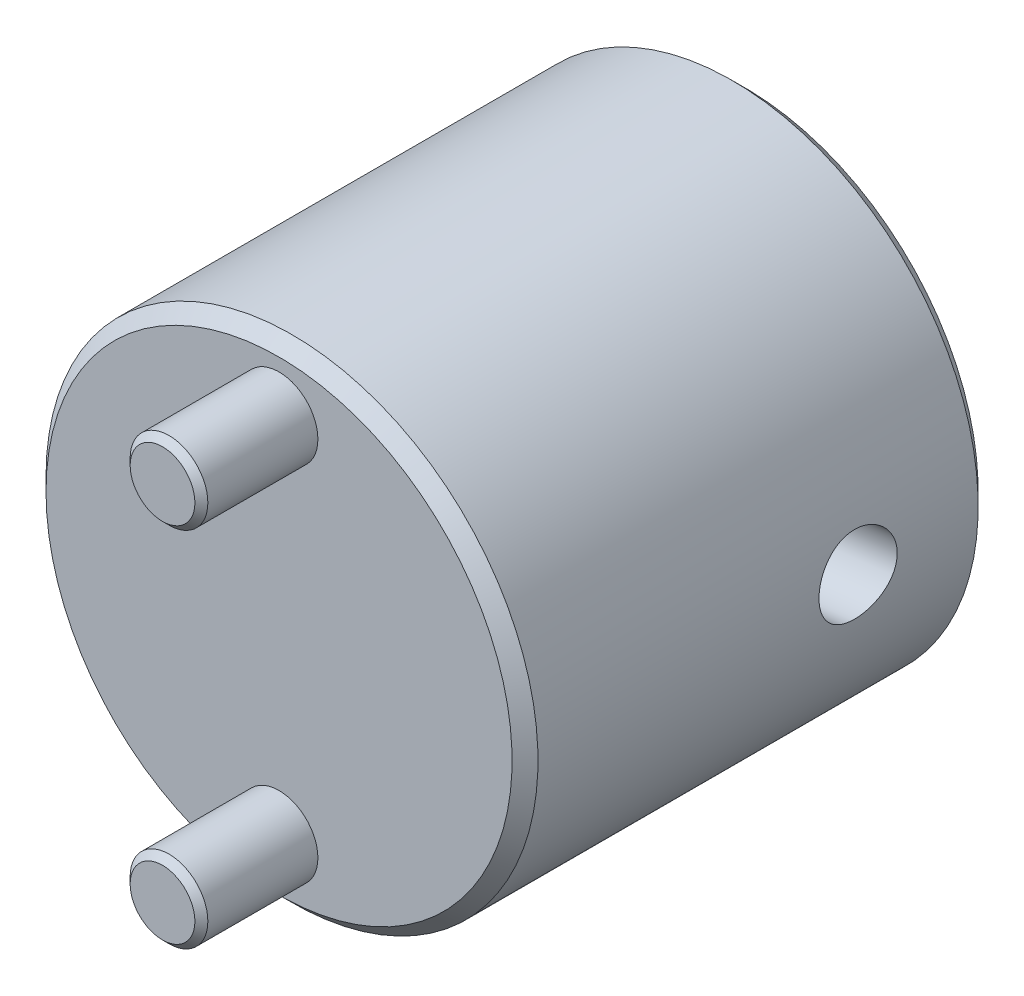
ISO-10303-21;
HEADER;
FILE_DESCRIPTION(('STEP AP214'),'2;1');
FILE_NAME('part.step','',(''),(''),'','','');
FILE_SCHEMA(('AUTOMOTIVE_DESIGN { 1 0 10303 214 1 1 1 1 }'));
ENDSEC;
DATA;
#1=APPLICATION_CONTEXT('core data for automotive mechanical design processes');
#2=APPLICATION_PROTOCOL_DEFINITION('international standard','automotive_design',2000,#1);
#3=PRODUCT_CONTEXT('',#1,'mechanical');
#4=PRODUCT('Part','Part','',(#3));
#5=PRODUCT_RELATED_PRODUCT_CATEGORY('part','',(#4));
#6=PRODUCT_DEFINITION_FORMATION('','',#4);
#7=PRODUCT_DEFINITION_CONTEXT('part definition',#1,'design');
#8=PRODUCT_DEFINITION('design','',#6,#7);
#9=PRODUCT_DEFINITION_SHAPE('','',#8);
#10=(LENGTH_UNIT() NAMED_UNIT(*) SI_UNIT(.MILLI.,.METRE.));
#11=(NAMED_UNIT(*) PLANE_ANGLE_UNIT() SI_UNIT($,.RADIAN.));
#12=(NAMED_UNIT(*) SI_UNIT($,.STERADIAN.) SOLID_ANGLE_UNIT());
#13=UNCERTAINTY_MEASURE_WITH_UNIT(LENGTH_MEASURE(1.E-05),#10,'distance_accuracy_value','');
#14=(GEOMETRIC_REPRESENTATION_CONTEXT(3) GLOBAL_UNCERTAINTY_ASSIGNED_CONTEXT((#13)) GLOBAL_UNIT_ASSIGNED_CONTEXT((#10,
#11,#12)) REPRESENTATION_CONTEXT('',''));
#15=CARTESIAN_POINT('',(0.,0.,0.));
#16=DIRECTION('',(0.,0.,1.));
#17=DIRECTION('',(1.,0.,0.));
#18=AXIS2_PLACEMENT_3D('',#15,#16,#17);
#19=CARTESIAN_POINT('',(0.,0.,9.));
#20=DIRECTION('',(0.,0.,1.));
#21=DIRECTION('',(1.,0.,0.));
#22=AXIS2_PLACEMENT_3D('',#19,#20,#21);
#23=PLANE('',#22);
#24=CARTESIAN_POINT('',(0.,14.,9.));
#25=DIRECTION('',(0.,0.,1.));
#26=DIRECTION('',(1.,0.,0.));
#27=AXIS2_PLACEMENT_3D('',#24,#25,#26);
#28=CIRCLE('',#27,2.49998893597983);
#29=CARTESIAN_POINT('',(2.49998893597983,14.,9.));
#30=VERTEX_POINT('',#29);
#31=EDGE_CURVE('E17',#30,#30,#28,.F.);
#32=ORIENTED_EDGE('',*,*,#31,.F.);
#33=EDGE_LOOP('',(#32));
#34=FACE_BOUND('',#33,.T.);
#35=ADVANCED_FACE('F14',(#34),#23,.T.);
#36=CARTESIAN_POINT('',(0.,0.,9.));
#37=DIRECTION('',(0.,0.,1.));
#38=DIRECTION('',(1.,0.,0.));
#39=AXIS2_PLACEMENT_3D('',#36,#37,#38);
#40=PLANE('',#39);
#41=CARTESIAN_POINT('',(0.,-14.,9.));
#42=DIRECTION('',(0.,0.,1.));
#43=DIRECTION('',(1.,0.,0.));
#44=AXIS2_PLACEMENT_3D('',#41,#42,#43);
#45=CIRCLE('',#44,2.49998893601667);
#46=CARTESIAN_POINT('',(2.49998893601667,-14.,9.));
#47=VERTEX_POINT('',#46);
#48=EDGE_CURVE('E114',#47,#47,#45,.F.);
#49=ORIENTED_EDGE('',*,*,#48,.F.);
#50=EDGE_LOOP('',(#49));
#51=FACE_BOUND('',#50,.T.);
#52=ADVANCED_FACE('F104',(#51),#40,.T.);
#53=CARTESIAN_POINT('',(-0.3439196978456,0.,-6.22361545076));
#54=DIRECTION('',(0.121869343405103,0.,0.992546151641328));
#55=DIRECTION('',(0.992546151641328,0.,-0.121869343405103));
#56=AXIS2_PLACEMENT_3D('',#53,#54,#55);
#57=PLANE('',#56);
#58=CARTESIAN_POINT('',(-0.34391969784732,0.,-6.22361545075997));
#59=DIRECTION('',(0.121869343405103,0.,0.992546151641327));
#60=DIRECTION('',(0.992546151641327,0.,-0.121869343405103));
#61=AXIS2_PLACEMENT_3D('',#58,#59,#60);
#62=CIRCLE('',#61,10.);
#63=CARTESIAN_POINT('',(9.58154181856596,0.,-7.44230888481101));
#64=VERTEX_POINT('',#63);
#65=EDGE_CURVE('E116',#64,#64,#62,.F.);
#66=ORIENTED_EDGE('',*,*,#65,.T.);
#67=EDGE_LOOP('',(#66));
#68=FACE_BOUND('',#67,.T.);
#69=ADVANCED_FACE('F101',(#68),#57,.F.);
#70=CARTESIAN_POINT('',(0.,14.,8.49999144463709));
#71=DIRECTION('',(0.,0.,-1.));
#72=DIRECTION('',(-1.,0.,0.));
#73=AXIS2_PLACEMENT_3D('',#70,#71,#72);
#74=CONICAL_SURFACE('',#73,2.99999527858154,0.785395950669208);
#75=CARTESIAN_POINT('',(0.,14.,8.49998672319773));
#76=DIRECTION('',(0.,0.,-1.));
#77=DIRECTION('',(-1.,0.,0.));
#78=AXIS2_PLACEMENT_3D('',#75,#76,#77);
#79=CIRCLE('',#78,3.);
#80=CARTESIAN_POINT('',(-3.,14.,8.49998672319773));
#81=VERTEX_POINT('',#80);
#82=EDGE_CURVE('E118',#81,#81,#79,.T.);
#83=ORIENTED_EDGE('',*,*,#82,.F.);
#84=EDGE_LOOP('',(#83));
#85=FACE_BOUND('',#84,.T.);
#86=ORIENTED_EDGE('',*,*,#31,.T.);
#87=EDGE_LOOP('',(#86));
#88=FACE_BOUND('',#87,.T.);
#89=ADVANCED_FACE('F97',(#85,#88),#74,.T.);
#90=CARTESIAN_POINT('',(0.,-14.,8.49999144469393));
#91=DIRECTION('',(0.,0.,-1.));
#92=DIRECTION('',(-1.,0.,0.));
#93=AXIS2_PLACEMENT_3D('',#90,#91,#92);
#94=CONICAL_SURFACE('',#93,2.99999527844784,0.785395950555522);
#95=CARTESIAN_POINT('',(0.,-14.,8.49998672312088));
#96=DIRECTION('',(0.,0.,-1.));
#97=DIRECTION('',(-1.,0.,0.));
#98=AXIS2_PLACEMENT_3D('',#95,#96,#97);
#99=CIRCLE('',#98,3.);
#100=CARTESIAN_POINT('',(-3.,-14.,8.49998672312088));
#101=VERTEX_POINT('',#100);
#102=EDGE_CURVE('E123',#101,#101,#99,.T.);
#103=ORIENTED_EDGE('',*,*,#102,.F.);
#104=EDGE_LOOP('',(#103));
#105=FACE_BOUND('',#104,.T.);
#106=ORIENTED_EDGE('',*,*,#48,.T.);
#107=EDGE_LOOP('',(#106));
#108=FACE_BOUND('',#107,.T.);
#109=ADVANCED_FACE('F92',(#105,#108),#94,.T.);
#110=CARTESIAN_POINT('',(-5.624587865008,0.,-49.23120637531));
#111=DIRECTION('',(0.121869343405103,0.,0.992546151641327));
#112=DIRECTION('',(0.992546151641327,0.,-0.121869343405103));
#113=AXIS2_PLACEMENT_3D('',#110,#111,#112);
#114=CYLINDRICAL_SURFACE('',#113,10.);
#115=CARTESIAN_POINT('',(-4.00000000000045,0.,-36.));
#116=DIRECTION('',(0.,0.,-1.));
#117=DIRECTION('',(1.,0.,0.));
#118=AXIS2_PLACEMENT_3D('',#115,#116,#117);
#119=ELLIPSE('',#118,10.0750982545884,10.);
#120=CARTESIAN_POINT('',(6.07509825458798,0.,-36.));
#121=VERTEX_POINT('',#120);
#122=EDGE_CURVE('E79',#121,#121,#119,.F.);
#123=ORIENTED_EDGE('',*,*,#122,.F.);
#124=EDGE_LOOP('',(#123));
#125=FACE_BOUND('',#124,.T.);
#126=ORIENTED_EDGE('',*,*,#65,.F.);
#127=EDGE_LOOP('',(#126));
#128=FACE_BOUND('',#127,.T.);
#129=CARTESIAN_POINT('',(7.14415495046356,0.,-27.2932319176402));
#130=CARTESIAN_POINT('',(7.14415015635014,0.164364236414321,-27.2932223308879));
#131=CARTESIAN_POINT('',(7.14174241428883,0.328908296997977,-27.2792642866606));
#132=CARTESIAN_POINT('',(7.13247673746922,0.653366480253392,-27.2239101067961));
#133=CARTESIAN_POINT('',(7.12561096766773,0.813271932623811,-27.1824656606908));
#134=CARTESIAN_POINT('',(7.10854535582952,1.12348315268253,-27.0737554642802));
#135=CARTESIAN_POINT('',(7.09835236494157,1.27380789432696,-27.0065427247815));
#136=CARTESIAN_POINT('',(7.07627779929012,1.56129290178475,-26.8485454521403));
#137=CARTESIAN_POINT('',(7.06439652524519,1.69845550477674,-26.7577651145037));
#138=CARTESIAN_POINT('',(7.04065275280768,1.95973946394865,-26.5526527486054));
#139=CARTESIAN_POINT('',(7.02879876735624,2.08342924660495,-26.4377699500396));
#140=CARTESIAN_POINT('',(7.00780745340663,2.31049290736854,-26.1891745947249));
#141=CARTESIAN_POINT('',(6.99867073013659,2.41386225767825,-26.0554578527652));
#142=CARTESIAN_POINT('',(6.98534004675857,2.59960101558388,-25.7695782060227));
#143=CARTESIAN_POINT('',(6.9812616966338,2.68144668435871,-25.6170684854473));
#144=CARTESIAN_POINT('',(6.98066469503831,2.81842825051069,-25.3004742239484));
#145=CARTESIAN_POINT('',(6.98414417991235,2.87357072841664,-25.1363925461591));
#146=CARTESIAN_POINT('',(6.99997315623,2.95403265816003,-24.8063432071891));
#147=CARTESIAN_POINT('',(7.01207156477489,2.98014390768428,-24.6405569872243));
#148=CARTESIAN_POINT('',(7.04529850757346,3.00427461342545,-24.3078656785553));
#149=CARTESIAN_POINT('',(7.06642485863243,3.00230085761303,-24.1409608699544));
#150=CARTESIAN_POINT('',(7.11607054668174,2.9709395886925,-23.8171315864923));
#151=CARTESIAN_POINT('',(7.1442954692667,2.94254427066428,-23.6600643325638));
#152=CARTESIAN_POINT('',(7.20687651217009,2.86074869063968,-23.3538736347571));
#153=CARTESIAN_POINT('',(7.24123327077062,2.80734582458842,-23.2047510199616));
#154=CARTESIAN_POINT('',(7.31431211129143,2.67631861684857,-22.9161375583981));
#155=CARTESIAN_POINT('',(7.35308764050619,2.59837186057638,-22.776807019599));
#156=CARTESIAN_POINT('',(7.43186085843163,2.42069837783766,-22.5131930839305));
#157=CARTESIAN_POINT('',(7.47185876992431,2.32096766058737,-22.3889124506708));
#158=CARTESIAN_POINT('',(7.55181517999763,2.09764727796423,-22.1532510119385));
#159=CARTESIAN_POINT('',(7.59170281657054,1.97323765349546,-22.0426219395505));
#160=CARTESIAN_POINT('',(7.66647751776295,1.70657662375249,-21.8431890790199));
#161=CARTESIAN_POINT('',(7.70136242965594,1.56431758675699,-21.7543946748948));
#162=CARTESIAN_POINT('',(7.76342571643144,1.26458300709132,-21.6004775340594));
#163=CARTESIAN_POINT('',(7.79054500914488,1.10700242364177,-21.5355352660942));
#164=CARTESIAN_POINT('',(7.83424939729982,0.782158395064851,-21.4323735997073));
#165=CARTESIAN_POINT('',(7.8508562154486,0.614915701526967,-21.3940990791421));
#166=CARTESIAN_POINT('',(7.86607548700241,0.371824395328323,-21.3591752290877));
#167=CARTESIAN_POINT('',(7.86955335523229,0.297737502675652,-21.3512260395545));
#168=CARTESIAN_POINT('',(7.87420270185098,0.149112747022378,-21.3406140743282));
#169=CARTESIAN_POINT('',(7.87537417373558,0.0745748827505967,-21.3379513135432));
#170=CARTESIAN_POINT('',(7.87536403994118,-0.164364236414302,-21.3379631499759));
#171=CARTESIAN_POINT('',(7.86965106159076,-0.328908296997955,-21.3509240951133));
#172=CARTESIAN_POINT('',(7.84726922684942,-0.653366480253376,-21.4023924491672));
#173=CARTESIAN_POINT('',(7.83058108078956,-0.813271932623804,-21.4409448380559));
#174=CARTESIAN_POINT('',(7.78772301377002,-1.12348315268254,-21.5422973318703));
#175=CARTESIAN_POINT('',(7.76157256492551,-1.27380789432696,-21.6050476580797));
#176=CARTESIAN_POINT('',(7.70193070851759,-1.56129290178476,-21.7530114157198));
#177=CARTESIAN_POINT('',(7.66844060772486,-1.69845550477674,-21.8382208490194));
#178=CARTESIAN_POINT('',(7.59578095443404,-1.95973946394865,-22.0314963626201));
#179=CARTESIAN_POINT('',(7.55648641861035,-2.08342924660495,-22.1400989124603));
#180=CARTESIAN_POINT('',(7.47597797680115,-2.31049290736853,-22.3762316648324));
#181=CARTESIAN_POINT('',(7.43476364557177,-2.41386225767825,-22.5037660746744));
#182=CARTESIAN_POINT('',(7.35266839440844,-2.59960101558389,-22.7779288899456));
#183=CARTESIAN_POINT('',(7.31181574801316,-2.68144668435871,-22.9249217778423));
#184=CARTESIAN_POINT('',(7.23464539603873,-2.81842825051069,-23.2319674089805));
#185=CARTESIAN_POINT('',(7.19832657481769,-2.87357072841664,-23.3920169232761));
#186=CARTESIAN_POINT('',(7.13383920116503,-2.95403265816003,-23.7160917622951));
#187=CARTESIAN_POINT('',(7.1054709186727,-2.98014390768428,-23.8798802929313));
#188=CARTESIAN_POINT('',(7.05722556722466,-3.00427461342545,-24.2107275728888));
#189=CARTESIAN_POINT('',(7.03734644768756,-3.00230085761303,-24.3777855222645));
#190=CARTESIAN_POINT('',(7.00717605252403,-2.9709395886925,-24.704006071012));
#191=CARTESIAN_POINT('',(6.9965645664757,-2.94254427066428,-24.8632359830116));
#192=CARTESIAN_POINT('',(6.98321245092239,-2.86074869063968,-25.1754712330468));
#193=CARTESIAN_POINT('',(6.98047264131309,-2.80734582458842,-25.3284759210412));
#194=CARTESIAN_POINT('',(6.98155881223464,-2.67631861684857,-25.626195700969));
#195=CARTESIAN_POINT('',(6.98547543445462,-2.59837186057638,-25.770768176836));
#196=CARTESIAN_POINT('',(6.99813476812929,-2.42069837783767,-26.045608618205));
#197=CARTESIAN_POINT('',(7.0068783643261,-2.32096766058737,-26.1758739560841));
#198=CARTESIAN_POINT('',(7.02744806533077,-2.09764727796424,-26.4238784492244));
#199=CARTESIAN_POINT('',(7.03938727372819,-1.97323765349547,-26.540871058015));
#200=CARTESIAN_POINT('',(7.06369367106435,-1.7065766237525,-26.7524695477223));
#201=CARTESIAN_POINT('',(7.07606104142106,-1.56431758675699,-26.847065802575));
#202=CARTESIAN_POINT('',(7.0990448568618,-1.26458300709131,-27.0114254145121));
#203=CARTESIAN_POINT('',(7.10964763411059,-1.10700242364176,-27.080999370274));
#204=CARTESIAN_POINT('',(7.12709674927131,-0.782158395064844,-27.1916697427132));
#205=CARTESIAN_POINT('',(7.13395082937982,-0.614915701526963,-27.2328248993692));
#206=CARTESIAN_POINT('',(7.14026917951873,-0.371824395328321,-27.2703932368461));
#207=CARTESIAN_POINT('',(7.14172065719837,-0.297737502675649,-27.2789476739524));
#208=CARTESIAN_POINT('',(7.14366463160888,-0.149112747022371,-27.2903691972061));
#209=CARTESIAN_POINT('',(7.14415712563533,-0.0745748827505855,-27.2932362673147));
#210=CARTESIAN_POINT('',(7.14415495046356,0.,-27.2932319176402));
#211=B_SPLINE_CURVE_WITH_KNOTS('',3,(#129,#130,#131,#132,#133,#134,#135,#136,#137,#138,#139,
#140,#141,#142,#143,#144,#145,#146,#147,#148,#149,#150,#151,#152,#153,#154,#155,#156,#157,#158,
#159,#160,#161,#162,#163,#164,#165,#166,#167,#168,#169,#170,#171,#172,#173,#174,#175,#176,#177,
#178,#179,#180,#181,#182,#183,#184,#185,#186,#187,#188,#189,#190,#191,#192,#193,#194,#195,#196,
#197,#198,#199,#200,#201,#202,#203,#204,#205,#206,#207,#208,#209,#210),.UNSPECIFIED.,.T.,.F.,(4,
2,2,2,2,2,2,2,2,2,2,2,2,2,2,2,2,2,2,2,2,2,2,2,2,2,2,2,2,2,2,2,2,2,2,2,2,2,2,2,4),(0.,
0.492805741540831,0.986479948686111,1.47914396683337,1.97172034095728,2.47709830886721,
2.98258875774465,3.49943124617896,4.01614630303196,4.51839363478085,5.02051957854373,
5.50451902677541,5.98856888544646,6.47926306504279,6.97004721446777,7.48124851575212,
7.99266913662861,8.507883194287,9.02202912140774,9.2456229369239,9.46921738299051,
9.96202312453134,10.4556973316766,10.9483613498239,11.4409377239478,11.9463156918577,
12.4518061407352,12.9686486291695,13.4853636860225,13.9876110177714,14.4897369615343,
14.9737364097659,15.457786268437,15.9484804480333,16.4392645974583,16.9504658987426,
17.4618865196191,17.9771005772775,18.4912465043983,18.7148403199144,18.938434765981),.UNSPECIFIED.);
#212=CARTESIAN_POINT('',(7.14415495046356,0.,-27.2932319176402));
#213=VERTEX_POINT('',#212);
#214=EDGE_CURVE('E76',#213,#213,#211,.T.);
#215=ORIENTED_EDGE('',*,*,#214,.T.);
#216=EDGE_LOOP('',(#215));
#217=FACE_BOUND('',#216,.T.);
#218=ADVANCED_FACE('F86',(#125,#128,#217),#114,.F.);
#219=CARTESIAN_POINT('',(0.,14.,0.));
#220=DIRECTION('',(0.,0.,1.));
#221=DIRECTION('',(1.,0.,0.));
#222=AXIS2_PLACEMENT_3D('',#219,#220,#221);
#223=CYLINDRICAL_SURFACE('',#222,3.);
#224=CARTESIAN_POINT('',(0.,14.,0.));
#225=DIRECTION('',(0.,0.,1.));
#226=DIRECTION('',(1.,0.,0.));
#227=AXIS2_PLACEMENT_3D('',#224,#225,#226);
#228=CIRCLE('',#227,3.);
#229=CARTESIAN_POINT('',(3.,14.,0.));
#230=VERTEX_POINT('',#229);
#231=EDGE_CURVE('E72',#230,#230,#228,.T.);
#232=ORIENTED_EDGE('',*,*,#231,.T.);
#233=EDGE_LOOP('',(#232));
#234=FACE_BOUND('',#233,.T.);
#235=ORIENTED_EDGE('',*,*,#82,.T.);
#236=EDGE_LOOP('',(#235));
#237=FACE_BOUND('',#236,.T.);
#238=ADVANCED_FACE('F91',(#234,#237),#223,.T.);
#239=CARTESIAN_POINT('',(0.,-14.,0.));
#240=DIRECTION('',(0.,0.,1.));
#241=DIRECTION('',(1.,0.,0.));
#242=AXIS2_PLACEMENT_3D('',#239,#240,#241);
#243=CYLINDRICAL_SURFACE('',#242,3.);
#244=CARTESIAN_POINT('',(0.,-14.,0.));
#245=DIRECTION('',(0.,0.,1.));
#246=DIRECTION('',(1.,0.,0.));
#247=AXIS2_PLACEMENT_3D('',#244,#245,#246);
#248=CIRCLE('',#247,3.);
#249=CARTESIAN_POINT('',(3.,-14.,0.));
#250=VERTEX_POINT('',#249);
#251=EDGE_CURVE('E68',#250,#250,#248,.T.);
#252=ORIENTED_EDGE('',*,*,#251,.T.);
#253=EDGE_LOOP('',(#252));
#254=FACE_BOUND('',#253,.T.);
#255=ORIENTED_EDGE('',*,*,#102,.T.);
#256=EDGE_LOOP('',(#255));
#257=FACE_BOUND('',#256,.T.);
#258=ADVANCED_FACE('F139',(#254,#257),#243,.T.);
#259=CARTESIAN_POINT('',(0.,0.,-36.));
#260=DIRECTION('',(0.,0.,-1.));
#261=DIRECTION('',(-1.,0.,0.));
#262=AXIS2_PLACEMENT_3D('',#259,#260,#261);
#263=PLANE('',#262);
#264=ORIENTED_EDGE('',*,*,#122,.T.);
#265=EDGE_LOOP('',(#264));
#266=FACE_BOUND('',#265,.T.);
#267=CARTESIAN_POINT('',(0.,0.,-36.));
#268=DIRECTION('',(0.,0.,-1.));
#269=DIRECTION('',(-1.,0.,0.));
#270=AXIS2_PLACEMENT_3D('',#267,#268,#269);
#271=CIRCLE('',#270,17.9999935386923);
#272=CARTESIAN_POINT('',(-17.9999935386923,0.,-36.));
#273=VERTEX_POINT('',#272);
#274=EDGE_CURVE('E38',#273,#273,#271,.F.);
#275=ORIENTED_EDGE('',*,*,#274,.F.);
#276=EDGE_LOOP('',(#275));
#277=FACE_BOUND('',#276,.T.);
#278=ADVANCED_FACE('F63',(#266,#277),#263,.T.);
#279=CARTESIAN_POINT('',(-6.088156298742,0.,-22.6459789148));
#280=DIRECTION('',(0.992546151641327,0.,-0.121869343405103));
#281=DIRECTION('',(-0.121869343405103,0.,-0.992546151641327));
#282=AXIS2_PLACEMENT_3D('',#279,#280,#281);
#283=CYLINDRICAL_SURFACE('',#282,3.);
#284=ORIENTED_EDGE('',*,*,#214,.F.);
#285=EDGE_LOOP('',(#284));
#286=FACE_BOUND('',#285,.T.);
#287=CARTESIAN_POINT('',(19.,0.,-22.7038876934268));
#288=CARTESIAN_POINT('',(18.999996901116,0.168375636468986,-22.7038949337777));
#289=CARTESIAN_POINT('',(18.9977368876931,0.336958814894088,-22.717947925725));
#290=CARTESIAN_POINT('',(18.9889306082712,0.669566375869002,-22.773855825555));
#291=CARTESIAN_POINT('',(18.9823758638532,0.833581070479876,-22.8157657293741));
#292=CARTESIAN_POINT('',(18.9657103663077,1.15205522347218,-22.9262623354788));
#293=CARTESIAN_POINT('',(18.9556024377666,1.30652215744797,-22.9948278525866));
#294=CARTESIAN_POINT('',(18.9329581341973,1.60156617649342,-23.1567661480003));
#295=CARTESIAN_POINT('',(18.9204227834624,1.74214908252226,-23.2501284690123));
#296=CARTESIAN_POINT('',(18.8943204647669,2.00554261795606,-23.4591755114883));
#297=CARTESIAN_POINT('',(18.8807533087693,2.12834999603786,-23.5748643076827));
#298=CARTESIAN_POINT('',(18.8541189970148,2.3526557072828,-23.825390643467));
#299=CARTESIAN_POINT('',(18.8410518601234,2.45415323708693,-23.9602289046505));
#300=CARTESIAN_POINT('',(18.8169550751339,2.63254643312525,-24.2446602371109));
#301=CARTESIAN_POINT('',(18.8059169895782,2.70954499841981,-24.394188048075));
#302=CARTESIAN_POINT('',(18.7870561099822,2.83737969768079,-24.7042177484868));
#303=CARTESIAN_POINT('',(18.7792331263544,2.88821737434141,-24.8647189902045));
#304=CARTESIAN_POINT('',(18.7676968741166,2.96225674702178,-25.1913413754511));
#305=CARTESIAN_POINT('',(18.7639651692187,2.98558245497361,-25.3574338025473));
#306=CARTESIAN_POINT('',(18.7609309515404,3.00459042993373,-25.6912252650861));
#307=CARTESIAN_POINT('',(18.7616286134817,3.00027160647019,-25.8589243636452));
#308=CARTESIAN_POINT('',(18.7673554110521,2.9642365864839,-26.192617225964));
#309=CARTESIAN_POINT('',(18.7724189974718,2.93230247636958,-26.3585867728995));
#310=CARTESIAN_POINT('',(18.7863216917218,2.84186394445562,-26.6829582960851));
#311=CARTESIAN_POINT('',(18.7951613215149,2.78335584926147,-26.8413592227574));
#312=CARTESIAN_POINT('',(18.8158348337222,2.64001667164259,-27.1495088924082));
#313=CARTESIAN_POINT('',(18.8277259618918,2.55467438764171,-27.2990161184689));
#314=CARTESIAN_POINT('',(18.8530646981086,2.36040600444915,-27.5816856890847));
#315=CARTESIAN_POINT('',(18.8665123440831,2.25147933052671,-27.7148476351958));
#316=CARTESIAN_POINT('',(18.8935991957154,2.0116154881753,-27.9623270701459));
#317=CARTESIAN_POINT('',(18.9072389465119,1.88046287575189,-28.0764360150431));
#318=CARTESIAN_POINT('',(18.9330027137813,1.60035758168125,-28.2805984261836));
#319=CARTESIAN_POINT('',(18.9451261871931,1.45139855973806,-28.3706432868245));
#320=CARTESIAN_POINT('',(18.966224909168,1.14272283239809,-28.5221619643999));
#321=CARTESIAN_POINT('',(18.9752525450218,0.983245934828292,-28.5841175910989));
#322=CARTESIAN_POINT('',(18.9893718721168,0.656050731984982,-28.6794338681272));
#323=CARTESIAN_POINT('',(18.9944729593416,0.488353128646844,-28.7128628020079));
#324=CARTESIAN_POINT('',(18.9982095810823,0.26623215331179,-28.7372831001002));
#325=CARTESIAN_POINT('',(18.9988796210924,0.213088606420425,-28.7416531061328));
#326=CARTESIAN_POINT('',(18.9997752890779,0.106637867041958,-28.7474862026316));
#327=CARTESIAN_POINT('',(19.0000009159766,0.0533306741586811,-28.7489492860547));
#328=CARTESIAN_POINT('',(18.9999971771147,-0.16435614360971,-28.7489385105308));
#329=CARTESIAN_POINT('',(18.9978427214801,-0.328935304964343,-28.7350093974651));
#330=CARTESIAN_POINT('',(18.9894543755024,-0.653541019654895,-28.6797311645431));
#331=CARTESIAN_POINT('',(18.9832118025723,-0.813557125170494,-28.6383236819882));
#332=CARTESIAN_POINT('',(18.9673581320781,-1.12402944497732,-28.5296210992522));
#333=CARTESIAN_POINT('',(18.9577533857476,-1.27450305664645,-28.4623747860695));
#334=CARTESIAN_POINT('',(18.9362209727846,-1.56216881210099,-28.3042337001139));
#335=CARTESIAN_POINT('',(18.9242940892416,-1.69936540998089,-28.2133468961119));
#336=CARTESIAN_POINT('',(18.8991111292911,-1.95987302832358,-28.0085093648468));
#337=CARTESIAN_POINT('',(18.8858324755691,-2.08283374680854,-27.8941161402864));
#338=CARTESIAN_POINT('',(18.8595856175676,-2.30845456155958,-27.6467563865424));
#339=CARTESIAN_POINT('',(18.8466174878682,-2.4111098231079,-27.5137854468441));
#340=CARTESIAN_POINT('',(18.8220237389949,-2.59623248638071,-27.2287197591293));
#341=CARTESIAN_POINT('',(18.8104485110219,-2.67802121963,-27.0761792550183));
#342=CARTESIAN_POINT('',(18.7904249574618,-2.81509396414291,-26.7594202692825));
#343=CARTESIAN_POINT('',(18.7819767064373,-2.87037734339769,-26.595201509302));
#344=CARTESIAN_POINT('',(18.7691935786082,-2.95281854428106,-26.2591993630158));
#345=CARTESIAN_POINT('',(18.7648699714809,-2.97989932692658,-26.087396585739));
#346=CARTESIAN_POINT('',(18.7609333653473,-3.00458761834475,-25.7416315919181));
#347=CARTESIAN_POINT('',(18.7613197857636,-3.00219875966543,-25.567669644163));
#348=CARTESIAN_POINT('',(18.7667493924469,-2.96806290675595,-25.2260921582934));
#349=CARTESIAN_POINT('',(18.7717032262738,-2.93687920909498,-25.0584188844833));
#350=CARTESIAN_POINT('',(18.7855978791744,-2.84664339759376,-24.7309214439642));
#351=CARTESIAN_POINT('',(18.7945384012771,-2.7875933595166,-24.5710966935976));
#352=CARTESIAN_POINT('',(18.815224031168,-2.64432821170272,-24.2663058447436));
#353=CARTESIAN_POINT('',(18.8269250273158,-2.56050413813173,-24.1211527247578));
#354=CARTESIAN_POINT('',(18.8518851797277,-2.36973535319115,-23.8471002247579));
#355=CARTESIAN_POINT('',(18.8651442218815,-2.26279233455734,-23.718199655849));
#356=CARTESIAN_POINT('',(18.8917427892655,-2.02876719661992,-23.4801431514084));
#357=CARTESIAN_POINT('',(18.9050823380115,-1.90167888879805,-23.370993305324));
#358=CARTESIAN_POINT('',(18.9303634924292,-1.63088940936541,-23.175373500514));
#359=CARTESIAN_POINT('',(18.9423044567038,-1.48718067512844,-23.0889139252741));
#360=CARTESIAN_POINT('',(18.9635336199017,-1.18628909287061,-22.9405620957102));
#361=CARTESIAN_POINT('',(18.9728043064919,-1.02902570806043,-22.8788310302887));
#362=CARTESIAN_POINT('',(18.9875445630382,-0.706461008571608,-22.7824763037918));
#363=CARTESIAN_POINT('',(18.9930215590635,-0.541176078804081,-22.7477996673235));
#364=CARTESIAN_POINT('',(18.9975366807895,-0.312244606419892,-22.7193375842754));
#365=CARTESIAN_POINT('',(18.9984584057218,-0.249948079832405,-22.7135482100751));
#366=CARTESIAN_POINT('',(18.9996906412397,-0.125110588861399,-22.7058219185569));
#367=CARTESIAN_POINT('',(19.0000011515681,-0.0625696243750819,-22.7038850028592));
#368=CARTESIAN_POINT('',(19.,0.,-22.7038876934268));
#369=B_SPLINE_CURVE_WITH_KNOTS('',3,(#287,#288,#289,#290,#291,#292,#293,#294,#295,#296,#297,
#298,#299,#300,#301,#302,#303,#304,#305,#306,#307,#308,#309,#310,#311,#312,#313,#314,#315,#316,
#317,#318,#319,#320,#321,#322,#323,#324,#325,#326,#327,#328,#329,#330,#331,#332,#333,#334,#335,
#336,#337,#338,#339,#340,#341,#342,#343,#344,#345,#346,#347,#348,#349,#350,#351,#352,#353,#354,
#355,#356,#357,#358,#359,#360,#361,#362,#363,#364,#365,#366,#367,#368),.UNSPECIFIED.,.T.,.F.,(4,
2,2,2,2,2,2,2,2,2,2,2,2,2,2,2,2,2,2,2,2,2,2,2,2,2,2,2,2,2,2,2,2,2,2,2,2,2,2,2,4),(0.,
0.504891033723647,1.0107818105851,1.51627133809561,2.02154802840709,2.5269170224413,
3.03230506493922,3.53554149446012,4.03874824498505,4.5396779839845,5.04062748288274,
5.54556644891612,6.05057523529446,6.56585585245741,7.08114902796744,7.60175733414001,
8.12255156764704,8.63403921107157,9.14429905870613,9.30422329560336,9.46414791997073,
9.95700864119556,10.4509195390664,10.9439024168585,11.4367193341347,11.9398402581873,
12.443080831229,12.9610478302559,13.4790271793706,13.9984177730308,14.5177443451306,
15.0271220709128,15.5364618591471,16.0381563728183,16.5398141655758,17.0416263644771,
17.5436678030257,18.0489304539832,18.5532012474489,18.7408223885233,18.9284436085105),.UNSPECIFIED.);
#370=CARTESIAN_POINT('',(19.,0.,-22.7038876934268));
#371=VERTEX_POINT('',#370);
#372=EDGE_CURVE('E31',#371,#371,#369,.T.);
#373=ORIENTED_EDGE('',*,*,#372,.F.);
#374=EDGE_LOOP('',(#373));
#375=FACE_BOUND('',#374,.T.);
#376=ADVANCED_FACE('F40',(#286,#375),#283,.F.);
#377=CARTESIAN_POINT('',(0.,0.,0.));
#378=DIRECTION('',(0.,0.,-1.));
#379=DIRECTION('',(-1.,0.,0.));
#380=AXIS2_PLACEMENT_3D('',#377,#378,#379);
#381=PLANE('',#380);
#382=ORIENTED_EDGE('',*,*,#251,.F.);
#383=EDGE_LOOP('',(#382));
#384=FACE_BOUND('',#383,.T.);
#385=ORIENTED_EDGE('',*,*,#231,.F.);
#386=EDGE_LOOP('',(#385));
#387=FACE_BOUND('',#386,.T.);
#388=CARTESIAN_POINT('',(0.,0.,0.));
#389=DIRECTION('',(0.,0.,-1.));
#390=DIRECTION('',(-1.,0.,0.));
#391=AXIS2_PLACEMENT_3D('',#388,#389,#390);
#392=CIRCLE('',#391,17.9999934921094);
#393=CARTESIAN_POINT('',(-17.9999934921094,0.,0.));
#394=VERTEX_POINT('',#393);
#395=EDGE_CURVE('E26',#394,#394,#392,.T.);
#396=ORIENTED_EDGE('',*,*,#395,.F.);
#397=EDGE_LOOP('',(#396));
#398=FACE_BOUND('',#397,.T.);
#399=ADVANCED_FACE('F55',(#384,#387,#398),#381,.F.);
#400=CARTESIAN_POINT('',(0.,0.,-34.99999620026));
#401=DIRECTION('',(0.,0.,1.));
#402=DIRECTION('',(1.,0.,0.));
#403=AXIS2_PLACEMENT_3D('',#400,#401,#402);
#404=CONICAL_SURFACE('',#403,18.9999969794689,0.785397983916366);
#405=ORIENTED_EDGE('',*,*,#274,.T.);
#406=EDGE_LOOP('',(#405));
#407=FACE_BOUND('',#406,.T.);
#408=CARTESIAN_POINT('',(0.,0.,-34.99999922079));
#409=DIRECTION('',(0.,0.,-1.));
#410=DIRECTION('',(-1.,0.,0.));
#411=AXIS2_PLACEMENT_3D('',#408,#409,#410);
#412=CIRCLE('',#411,19.);
#413=CARTESIAN_POINT('',(-19.,0.,-34.99999922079));
#414=VERTEX_POINT('',#413);
#415=EDGE_CURVE('E21',#414,#414,#412,.F.);
#416=ORIENTED_EDGE('',*,*,#415,.F.);
#417=EDGE_LOOP('',(#416));
#418=FACE_BOUND('',#417,.T.);
#419=ADVANCED_FACE('F52',(#407,#418),#404,.T.);
#420=CARTESIAN_POINT('',(0.,0.,-1.00000391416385));
#421=DIRECTION('',(0.,0.,-1.));
#422=DIRECTION('',(-1.,0.,0.));
#423=AXIS2_PLACEMENT_3D('',#420,#421,#422);
#424=CONICAL_SURFACE('',#423,18.9999970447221,0.785397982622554);
#425=CARTESIAN_POINT('',(0.,0.,-1.000000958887));
#426=DIRECTION('',(0.,0.,-1.));
#427=DIRECTION('',(-1.,0.,0.));
#428=AXIS2_PLACEMENT_3D('',#425,#426,#427);
#429=CIRCLE('',#428,19.);
#430=CARTESIAN_POINT('',(-19.,0.,-1.000000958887));
#431=VERTEX_POINT('',#430);
#432=EDGE_CURVE('E9',#431,#431,#429,.T.);
#433=ORIENTED_EDGE('',*,*,#432,.F.);
#434=EDGE_LOOP('',(#433));
#435=FACE_BOUND('',#434,.T.);
#436=ORIENTED_EDGE('',*,*,#395,.T.);
#437=EDGE_LOOP('',(#436));
#438=FACE_BOUND('',#437,.T.);
#439=ADVANCED_FACE('F48',(#435,#438),#424,.T.);
#440=CARTESIAN_POINT('',(0.,0.,1.8));
#441=DIRECTION('',(0.,0.,-1.));
#442=DIRECTION('',(-1.,0.,0.));
#443=AXIS2_PLACEMENT_3D('',#440,#441,#442);
#444=CYLINDRICAL_SURFACE('',#443,19.);
#445=ORIENTED_EDGE('',*,*,#415,.T.);
#446=EDGE_LOOP('',(#445));
#447=FACE_BOUND('',#446,.T.);
#448=ORIENTED_EDGE('',*,*,#432,.T.);
#449=EDGE_LOOP('',(#448));
#450=FACE_BOUND('',#449,.T.);
#451=ORIENTED_EDGE('',*,*,#372,.T.);
#452=EDGE_LOOP('',(#451));
#453=FACE_BOUND('',#452,.T.);
#454=ADVANCED_FACE('F44',(#447,#450,#453),#444,.T.);
#455=CLOSED_SHELL('',(#35,#52,#69,#89,#109,#218,#238,#258,#278,#376,#399,#419,#439,#454));
#456=MANIFOLD_SOLID_BREP('B1',#455);
#457=ADVANCED_BREP_SHAPE_REPRESENTATION('',(#18,#456),#14);
#458=SHAPE_DEFINITION_REPRESENTATION(#9,#457);
ENDSEC;
END-ISO-10303-21;
